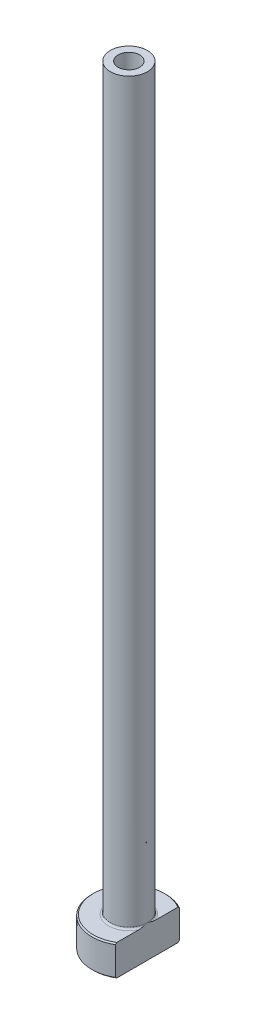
from build123d import *

# Parameters (mm, degrees)
FILLET1_R          = 0.3
CHAMFER1_SIZE      = 0.2
CUT_EXTRUDE1_DEPTH = 126.287668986
CHAMFER2_SIZE      = 0.5


with BuildPart() as part:
    # Sketch1 → Revolve1 (revolve)
    with BuildSketch(Plane.XY, mode=Mode.PRIVATE) as revolve1_sk:
        Polygon((-1.75, 125), (-3, 125), (-3, 5), (-6, 5), (-6, 0), (-2, 0), (-2, 68), (-1.75, 80), align=None)
    revolve(revolve1_sk.sketch.rotate(Axis((0, 92.187680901, 0), (0, -1, 0)), 270), axis=Axis((0, 92.187680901, 0), (0, -1, 0)))

    # Fillet1
    fillet1_edges = [part.edges().sort_by_distance(p)[0] for p in [
        (0, 5, -3),
    ]]
    fillet(fillet1_edges, radius=FILLET1_R)

    # Chamfer1
    chamfer1_edges = [part.edges().sort_by_distance(p)[0] for p in [
        (0, 0, -6),
        (0, 5, -6),
    ]]
    chamfer(chamfer1_edges, length=CHAMFER1_SIZE)

    # Sketch2 → Cut-Extrude1 (cut, through all)
    with BuildSketch(Plane.XZ):
        with BuildLine():
            Line((3, 5.196152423), (3, -5.196152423))
            ThreePointArc((3, -5.196152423), (6, 0), (3, 5.196152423))
        make_face()
    extrude(amount=-CUT_EXTRUDE1_DEPTH, mode=Mode.SUBTRACT)

    # Chamfer2
    chamfer2_edges = [part.edges().sort_by_distance(p)[0] for p in [
        (0, 0, -2),
    ]]
    chamfer(chamfer2_edges, length=CHAMFER2_SIZE)


solid = part.part
